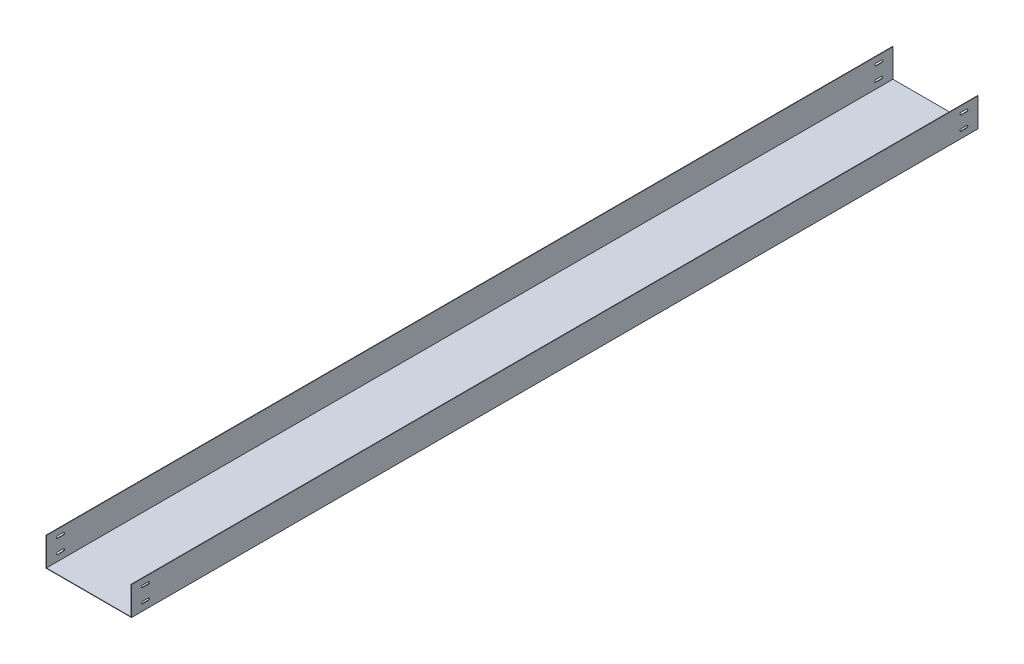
from build123d import *

# Parameters (mm, degrees)
EXTRUSION_DEPTH         = 3000
CUT_EXTRUDE1_DEPTH      = 3006.487023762
CUT_EXTRUDE1_DEPTH_BACK = 3006.487023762
CUT_EXTRUDE2_DEPTH      = 3006.487023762
CUT_EXTRUDE2_DEPTH_BACK = 3006.487023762


with BuildPart() as part:
    # DuctSketch → Extrusion (new body)
    with BuildSketch(Plane.XY):
        Polygon((-150, 100), (-150, 0), (150, 0), (150, 100), (151.5, 100), (151.5, -1.5), (-151.5, -1.5), (-151.5, 100), align=None)
    extrude(amount=EXTRUSION_DEPTH)

    # Sketch1 → Cut-Extrude1 (cut, two sides: drawn at the far end of the back side and taken through both)
    with BuildSketch(Plane(origin=(0, 0, 0), x_dir=(0, 0, -1), z_dir=(1, 0, 0)).offset(-CUT_EXTRUDE1_DEPTH_BACK)):
        with BuildLine():
            Line((-60, 79), (-40, 79))
            ThreePointArc((-40, 79), (-36, 75), (-40, 71))
            Line((-40, 71), (-60, 71))
            ThreePointArc((-60, 71), (-64, 75), (-60, 79))
        make_face()
        with BuildLine():
            Line((-60, 29), (-40, 29))
            ThreePointArc((-40, 29), (-36, 25), (-40, 21))
            Line((-40, 21), (-60, 21))
            ThreePointArc((-60, 21), (-64, 25), (-60, 29))
        make_face()
    extrude(amount=CUT_EXTRUDE1_DEPTH + CUT_EXTRUDE1_DEPTH_BACK, mode=Mode.SUBTRACT)

    # Sketch2 → Cut-Extrude2 (cut, two sides: drawn at the far end of the back side and taken through both)
    with BuildSketch(Plane(origin=(0, 0, 0), x_dir=(0, 0, -1), z_dir=(1, 0, 0)).offset(-CUT_EXTRUDE2_DEPTH_BACK)):
        with BuildLine():
            Line((-2960, 79), (-2940, 79))
            ThreePointArc((-2940, 79), (-2936, 75), (-2940, 71))
            Line((-2940, 71), (-2960, 71))
            ThreePointArc((-2960, 71), (-2964, 75), (-2960, 79))
        make_face()
        with BuildLine():
            Line((-2960, 29), (-2940, 29))
            ThreePointArc((-2940, 29), (-2936, 25), (-2940, 21))
            Line((-2940, 21), (-2960, 21))
            ThreePointArc((-2960, 21), (-2964, 25), (-2960, 29))
        make_face()
    extrude(amount=CUT_EXTRUDE2_DEPTH + CUT_EXTRUDE2_DEPTH_BACK, mode=Mode.SUBTRACT)


solid = part.part
